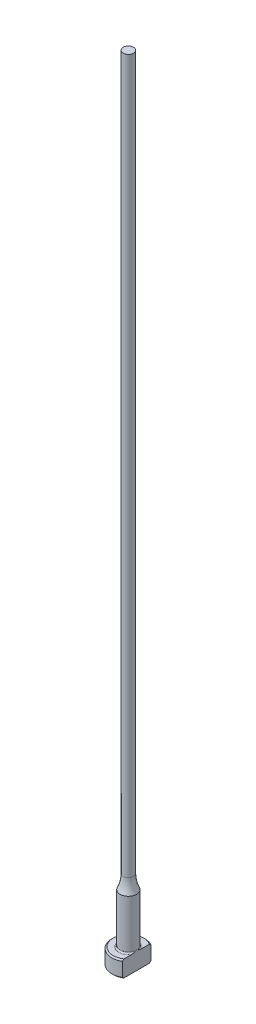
ISO-10303-21;
HEADER;
FILE_DESCRIPTION(('STEP AP214'),'2;1');
FILE_NAME('part.step','',(''),(''),'','','');
FILE_SCHEMA(('AUTOMOTIVE_DESIGN { 1 0 10303 214 1 1 1 1 }'));
ENDSEC;
DATA;
#1=APPLICATION_CONTEXT('core data for automotive mechanical design processes');
#2=APPLICATION_PROTOCOL_DEFINITION('international standard','automotive_design',2000,#1);
#3=PRODUCT_CONTEXT('',#1,'mechanical');
#4=PRODUCT('Part','Part','',(#3));
#5=PRODUCT_RELATED_PRODUCT_CATEGORY('part','',(#4));
#6=PRODUCT_DEFINITION_FORMATION('','',#4);
#7=PRODUCT_DEFINITION_CONTEXT('part definition',#1,'design');
#8=PRODUCT_DEFINITION('design','',#6,#7);
#9=PRODUCT_DEFINITION_SHAPE('','',#8);
#10=(LENGTH_UNIT() NAMED_UNIT(*) SI_UNIT(.MILLI.,.METRE.));
#11=(NAMED_UNIT(*) PLANE_ANGLE_UNIT() SI_UNIT($,.RADIAN.));
#12=(NAMED_UNIT(*) SI_UNIT($,.STERADIAN.) SOLID_ANGLE_UNIT());
#13=UNCERTAINTY_MEASURE_WITH_UNIT(LENGTH_MEASURE(1.E-05),#10,'distance_accuracy_value','');
#14=(GEOMETRIC_REPRESENTATION_CONTEXT(3) GLOBAL_UNCERTAINTY_ASSIGNED_CONTEXT((#13)) GLOBAL_UNIT_ASSIGNED_CONTEXT((#10,
#11,#12)) REPRESENTATION_CONTEXT('',''));
#15=CARTESIAN_POINT('',(0.,0.,0.));
#16=DIRECTION('',(0.,0.,1.));
#17=DIRECTION('',(1.,0.,0.));
#18=AXIS2_PLACEMENT_3D('',#15,#16,#17);
#19=CARTESIAN_POINT('',(-3.17499999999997,3.175,0.));
#20=DIRECTION('',(0.,1.,0.));
#21=DIRECTION('',(0.,0.,1.));
#22=AXIS2_PLACEMENT_3D('',#19,#20,#21);
#23=PLANE('',#22);
#24=CARTESIAN_POINT('',(0.,3.175,0.));
#25=DIRECTION('',(0.,1.,0.));
#26=DIRECTION('',(0.,0.,1.));
#27=AXIS2_PLACEMENT_3D('',#24,#25,#26);
#28=CIRCLE('',#27,2.92099999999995);
#29=CARTESIAN_POINT('',(1.58749999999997,3.175,-2.45195529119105));
#30=VERTEX_POINT('',#29);
#31=CARTESIAN_POINT('',(1.58749999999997,3.175,2.45195529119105));
#32=VERTEX_POINT('',#31);
#33=EDGE_CURVE('E105',#30,#32,#28,.T.);
#34=ORIENTED_EDGE('',*,*,#33,.T.);
#35=DIRECTION('',(0.,0.,1.));
#36=VECTOR('',#35,1.);
#37=CARTESIAN_POINT('',(1.58749999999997,3.17500000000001,2.74963065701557));
#38=LINE('',#37,#36);
#39=CARTESIAN_POINT('',(1.58749999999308,3.175,0.933255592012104));
#40=VERTEX_POINT('',#39);
#41=EDGE_CURVE('E126',#40,#32,#38,.T.);
#42=ORIENTED_EDGE('',*,*,#41,.F.);
#43=CARTESIAN_POINT('',(0.,3.175,0.));
#44=DIRECTION('',(0.,1.,0.));
#45=DIRECTION('',(0.,0.,1.));
#46=AXIS2_PLACEMENT_3D('',#43,#44,#45);
#47=CIRCLE('',#46,1.84149999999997);
#48=CARTESIAN_POINT('',(1.58749999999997,3.17500000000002,-0.933255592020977));
#49=VERTEX_POINT('',#48);
#50=EDGE_CURVE('E11',#40,#49,#47,.F.);
#51=ORIENTED_EDGE('',*,*,#50,.T.);
#52=EDGE_CURVE('E52',#30,#49,#38,.T.);
#53=ORIENTED_EDGE('',*,*,#52,.F.);
#54=EDGE_LOOP('',(#34,#42,#51,#53));
#55=FACE_BOUND('',#54,.T.);
#56=ADVANCED_FACE('F32',(#55),#23,.T.);
#57=CARTESIAN_POINT('',(0.,259.958771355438,0.));
#58=DIRECTION('',(0.,1.,0.));
#59=DIRECTION('',(0.,0.,1.));
#60=AXIS2_PLACEMENT_3D('',#57,#58,#59);
#61=CYLINDRICAL_SURFACE('',#60,3.17499999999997);
#62=CARTESIAN_POINT('',(0.,2.92100000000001,0.));
#63=DIRECTION('',(0.,1.,0.));
#64=DIRECTION('',(0.,0.,1.));
#65=AXIS2_PLACEMENT_3D('',#62,#63,#64);
#66=CIRCLE('',#65,3.17499999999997);
#67=CARTESIAN_POINT('',(1.58749999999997,2.92100000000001,2.74963065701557));
#68=VERTEX_POINT('',#67);
#69=CARTESIAN_POINT('',(1.58749999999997,2.92100000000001,-2.74963065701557));
#70=VERTEX_POINT('',#69);
#71=EDGE_CURVE('E98',#68,#70,#66,.F.);
#72=ORIENTED_EDGE('',*,*,#71,.T.);
#73=DIRECTION('',(0.,-1.,0.));
#74=VECTOR('',#73,1.);
#75=CARTESIAN_POINT('',(1.58749999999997,152.401,-2.74963065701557));
#76=LINE('',#75,#74);
#77=CARTESIAN_POINT('',(1.58749999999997,0.254000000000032,-2.74963065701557));
#78=VERTEX_POINT('',#77);
#79=EDGE_CURVE('E141',#70,#78,#76,.T.);
#80=ORIENTED_EDGE('',*,*,#79,.T.);
#81=CARTESIAN_POINT('',(0.,0.254000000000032,0.));
#82=DIRECTION('',(0.,-1.,0.));
#83=DIRECTION('',(0.,0.,-1.));
#84=AXIS2_PLACEMENT_3D('',#81,#82,#83);
#85=CIRCLE('',#84,3.17499999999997);
#86=CARTESIAN_POINT('',(1.58749999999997,0.254000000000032,2.74963065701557));
#87=VERTEX_POINT('',#86);
#88=EDGE_CURVE('E95',#78,#87,#85,.F.);
#89=ORIENTED_EDGE('',*,*,#88,.T.);
#90=DIRECTION('',(0.,-1.,0.));
#91=VECTOR('',#90,1.);
#92=CARTESIAN_POINT('',(1.58749999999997,152.401,2.74963065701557));
#93=LINE('',#92,#91);
#94=EDGE_CURVE('E88',#68,#87,#93,.T.);
#95=ORIENTED_EDGE('',*,*,#94,.F.);
#96=EDGE_LOOP('',(#72,#80,#89,#95));
#97=FACE_BOUND('',#96,.T.);
#98=ADVANCED_FACE('F191',(#97),#61,.T.);
#99=CARTESIAN_POINT('',(0.,0.,0.));
#100=DIRECTION('',(0.,-1.,0.));
#101=DIRECTION('',(0.,0.,-1.));
#102=AXIS2_PLACEMENT_3D('',#99,#100,#101);
#103=PLANE('',#102);
#104=CARTESIAN_POINT('',(0.,0.,0.));
#105=DIRECTION('',(0.,-1.,0.));
#106=DIRECTION('',(0.,0.,-1.));
#107=AXIS2_PLACEMENT_3D('',#104,#105,#106);
#108=CIRCLE('',#107,2.92099999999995);
#109=CARTESIAN_POINT('',(1.58749999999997,0.,2.45195529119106));
#110=VERTEX_POINT('',#109);
#111=CARTESIAN_POINT('',(1.58749999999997,0.,-2.45195529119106));
#112=VERTEX_POINT('',#111);
#113=EDGE_CURVE('E93',#110,#112,#108,.T.);
#114=ORIENTED_EDGE('',*,*,#113,.T.);
#115=DIRECTION('',(0.,0.,1.));
#116=VECTOR('',#115,1.);
#117=CARTESIAN_POINT('',(1.58749999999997,0.,2.74963065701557));
#118=LINE('',#117,#116);
#119=EDGE_CURVE('E78',#112,#110,#118,.T.);
#120=ORIENTED_EDGE('',*,*,#119,.T.);
#121=EDGE_LOOP('',(#114,#120));
#122=FACE_BOUND('',#121,.T.);
#123=ADVANCED_FACE('F97',(#122),#103,.T.);
#124=CARTESIAN_POINT('',(0.,3.17499999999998,0.));
#125=DIRECTION('',(0.,-1.,0.));
#126=DIRECTION('',(0.,0.,-1.));
#127=AXIS2_PLACEMENT_3D('',#124,#125,#126);
#128=CONICAL_SURFACE('',#127,2.92099999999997,0.7853981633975);
#129=ORIENTED_EDGE('',*,*,#71,.F.);
#130=CARTESIAN_POINT('',(1.58749999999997,-0.161620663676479,-6.0529050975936));
#131=CARTESIAN_POINT('',(1.58749999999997,-0.0288893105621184,-5.91567682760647));
#132=CARTESIAN_POINT('',(1.58749999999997,0.103699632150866,-5.77831035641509));
#133=CARTESIAN_POINT('',(1.58749999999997,0.36850839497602,-5.5032187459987));
#134=CARTESIAN_POINT('',(1.58749999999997,0.500728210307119,-5.36549360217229));
#135=CARTESIAN_POINT('',(1.58749999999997,0.764778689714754,-5.08953516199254));
#136=CARTESIAN_POINT('',(1.58749999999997,0.896609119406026,-4.95130164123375));
#137=CARTESIAN_POINT('',(1.58749999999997,1.15968706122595,-4.67428233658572));
#138=CARTESIAN_POINT('',(1.58749999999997,1.29093457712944,-4.53549655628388));
#139=CARTESIAN_POINT('',(1.58749999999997,1.55007705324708,-4.25997724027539));
#140=CARTESIAN_POINT('',(1.58749999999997,1.67798684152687,-4.12325766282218));
#141=CARTESIAN_POINT('',(1.58749999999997,1.93284861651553,-3.84892898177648));
#142=CARTESIAN_POINT('',(1.58749999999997,2.05980060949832,-3.71131988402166));
#143=CARTESIAN_POINT('',(1.58749999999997,2.31237508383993,-3.43493978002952));
#144=CARTESIAN_POINT('',(1.58749999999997,2.43799784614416,-3.29616903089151));
#145=CARTESIAN_POINT('',(1.58749999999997,2.68741369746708,-3.01699558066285));
#146=CARTESIAN_POINT('',(1.58749999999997,2.81120686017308,-2.87659294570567));
#147=CARTESIAN_POINT('',(1.58749999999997,3.0087586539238,-2.6481670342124));
#148=CARTESIAN_POINT('',(1.58749999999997,3.08336151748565,-2.56087478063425));
#149=CARTESIAN_POINT('',(1.58749999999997,3.23123871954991,-2.38515423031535));
#150=CARTESIAN_POINT('',(1.58749999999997,3.30451292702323,-2.29672582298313));
#151=CARTESIAN_POINT('',(1.58749999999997,3.45004422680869,-2.1174740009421));
#152=CARTESIAN_POINT('',(1.58749999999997,3.52228237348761,-2.02663514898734));
#153=CARTESIAN_POINT('',(1.58749999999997,3.6642309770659,-1.8430252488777));
#154=CARTESIAN_POINT('',(1.58749999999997,3.73394203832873,-1.75025467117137));
#155=CARTESIAN_POINT('',(1.58749999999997,3.87080633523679,-1.56067475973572));
#156=CARTESIAN_POINT('',(1.58749999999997,3.93790459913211,-1.46382547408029));
#157=CARTESIAN_POINT('',(1.58749999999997,4.06669147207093,-1.26632594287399));
#158=CARTESIAN_POINT('',(1.58749999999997,4.12837264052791,-1.16567073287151));
#159=CARTESIAN_POINT('',(1.58749999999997,4.2140225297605,-1.01165766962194));
#160=CARTESIAN_POINT('',(1.58749999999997,4.24127929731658,-0.960142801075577));
#161=CARTESIAN_POINT('',(1.58749999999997,4.29309798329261,-0.855780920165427));
#162=CARTESIAN_POINT('',(1.58749999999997,4.31765941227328,-0.802933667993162));
#163=CARTESIAN_POINT('',(1.58749999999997,4.38614656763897,-0.64246114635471));
#164=CARTESIAN_POINT('',(1.58749999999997,4.42510149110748,-0.532518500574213));
#165=CARTESIAN_POINT('',(1.58749999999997,4.46726244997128,-0.367680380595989));
#166=CARTESIAN_POINT('',(1.58749999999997,4.47844427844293,-0.314802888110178));
#167=CARTESIAN_POINT('',(1.58749999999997,4.495766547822,-0.2082097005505));
#168=CARTESIAN_POINT('',(1.58749999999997,4.50190743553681,-0.154494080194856));
#169=CARTESIAN_POINT('',(1.58749999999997,4.50871296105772,-0.0468792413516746));
#170=CARTESIAN_POINT('',(1.58749999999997,4.50939451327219,0.0070188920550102));
#171=CARTESIAN_POINT('',(1.58749999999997,4.50527679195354,0.114606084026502));
#172=CARTESIAN_POINT('',(1.58749999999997,4.50047706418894,0.168295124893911));
#173=CARTESIAN_POINT('',(1.58749999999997,4.48579689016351,0.274485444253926));
#174=CARTESIAN_POINT('',(1.58749999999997,4.47596081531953,0.326992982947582));
#175=CARTESIAN_POINT('',(1.58749999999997,4.45181809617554,0.430974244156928));
#176=CARTESIAN_POINT('',(1.58749999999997,4.43750969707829,0.48244755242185));
#177=CARTESIAN_POINT('',(1.58749999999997,4.40502489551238,0.584460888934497));
#178=CARTESIAN_POINT('',(1.58749999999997,4.38682724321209,0.634994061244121));
#179=CARTESIAN_POINT('',(1.58749999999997,4.34729308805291,0.734789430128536));
#180=CARTESIAN_POINT('',(1.58749999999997,4.32595722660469,0.784051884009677));
#181=CARTESIAN_POINT('',(1.58749999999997,4.25791922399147,0.930549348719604));
#182=CARTESIAN_POINT('',(1.58749999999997,4.20736047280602,1.02598802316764));
#183=CARTESIAN_POINT('',(1.58749999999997,4.09955451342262,1.2130431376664));
#184=CARTESIAN_POINT('',(1.58749999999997,4.04229912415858,1.30465471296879));
#185=CARTESIAN_POINT('',(1.58749999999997,3.9230874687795,1.4852621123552));
#186=CARTESIAN_POINT('',(1.58749999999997,3.86111349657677,1.57424615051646));
#187=CARTESIAN_POINT('',(1.58749999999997,3.73408621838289,1.74990003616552));
#188=CARTESIAN_POINT('',(1.58749999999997,3.66903444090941,1.8365709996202));
#189=CARTESIAN_POINT('',(1.58749999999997,3.53583371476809,2.00931764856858));
#190=CARTESIAN_POINT('',(1.58749999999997,3.46765527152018,2.09537048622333));
#191=CARTESIAN_POINT('',(1.58749999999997,3.32960643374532,2.26611736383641));
#192=CARTESIAN_POINT('',(1.58749999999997,3.25973586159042,2.35081125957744));
#193=CARTESIAN_POINT('',(1.58749999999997,3.04858139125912,2.60290121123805));
#194=CARTESIAN_POINT('',(1.58749999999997,2.90542388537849,2.76872537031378));
#195=CARTESIAN_POINT('',(1.58749999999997,2.64069522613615,3.06970913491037));
#196=CARTESIAN_POINT('',(1.58749999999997,2.5195945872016,3.20528660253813));
#197=CARTESIAN_POINT('',(1.58749999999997,2.275904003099,3.47510321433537));
#198=CARTESIAN_POINT('',(1.58749999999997,2.15331401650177,3.60934232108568));
#199=CARTESIAN_POINT('',(1.58749999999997,1.90694239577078,3.87695374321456));
#200=CARTESIAN_POINT('',(1.58749999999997,1.78315974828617,4.01032512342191));
#201=CARTESIAN_POINT('',(1.58749999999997,1.53478104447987,4.2763088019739));
#202=CARTESIAN_POINT('',(1.58749999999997,1.41018498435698,4.40892109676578));
#203=CARTESIAN_POINT('',(1.58749999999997,1.0457468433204,4.79499418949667));
#204=CARTESIAN_POINT('',(1.58749999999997,0.805076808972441,5.04767313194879));
#205=CARTESIAN_POINT('',(1.58749999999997,0.443121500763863,5.42550911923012));
#206=CARTESIAN_POINT('',(1.58749999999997,0.322378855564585,5.55118772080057));
#207=CARTESIAN_POINT('',(1.58749999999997,0.0805914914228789,5.80225207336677));
#208=CARTESIAN_POINT('',(1.58749999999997,-0.0404532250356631,5.92763782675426));
#209=CARTESIAN_POINT('',(1.58749999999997,-0.161620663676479,6.0529050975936));
#210=B_SPLINE_CURVE_WITH_KNOTS('',3,(#130,#131,#132,#133,#134,#135,#136,#137,#138,#139,#140,
#141,#142,#143,#144,#145,#146,#147,#148,#149,#150,#151,#152,#153,#154,#155,#156,#157,#158,#159,
#160,#161,#162,#163,#164,#165,#166,#167,#168,#169,#170,#171,#172,#173,#174,#175,#176,#177,#178,
#179,#180,#181,#182,#183,#184,#185,#186,#187,#188,#189,#190,#191,#192,#193,#194,#195,#196,#197,
#198,#199,#200,#201,#202,#203,#204,#205,#206,#207,#208,#209),.UNSPECIFIED.,.F.,.F.,(4,2,2,2,2,2,
2,2,2,2,2,2,2,2,2,2,2,2,2,2,2,2,2,2,2,2,2,2,2,2,2,2,2,2,2,2,2,2,2,4),(0.,0.572750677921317,
1.14550874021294,1.71856057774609,2.29160869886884,2.85328006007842,3.41494773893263,
3.97649423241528,4.53801804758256,4.88249307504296,5.22700189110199,5.57515326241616,
5.92322081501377,6.27657800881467,6.63041319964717,6.80518126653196,6.97998101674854,
7.32824262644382,7.49018491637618,7.65211285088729,7.813538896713,7.97497832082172,
8.13501929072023,8.29512313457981,8.4561251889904,8.61709438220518,8.94062993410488,
9.26456495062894,9.58978187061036,9.91483894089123,10.2441741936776,10.5735441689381,
11.2306812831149,11.7760337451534,12.3214014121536,12.8672825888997,13.4131663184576,
14.4600164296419,14.9828595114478,15.505698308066),.UNSPECIFIED.);
#211=EDGE_CURVE('E118',#32,#68,#210,.T.);
#212=ORIENTED_EDGE('',*,*,#211,.F.);
#213=ORIENTED_EDGE('',*,*,#33,.F.);
#214=EDGE_CURVE('E117',#70,#30,#210,.T.);
#215=ORIENTED_EDGE('',*,*,#214,.F.);
#216=EDGE_LOOP('',(#129,#212,#213,#215));
#217=FACE_BOUND('',#216,.T.);
#218=ADVANCED_FACE('F162',(#217),#128,.T.);
#219=CARTESIAN_POINT('',(0.,0.254000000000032,0.));
#220=DIRECTION('',(0.,1.,0.));
#221=DIRECTION('',(0.,0.,1.));
#222=AXIS2_PLACEMENT_3D('',#219,#220,#221);
#223=CONICAL_SURFACE('',#222,3.17499999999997,0.785398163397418);
#224=ORIENTED_EDGE('',*,*,#88,.F.);
#225=CARTESIAN_POINT('',(1.58749999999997,3.33662066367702,6.0529050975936));
#226=CARTESIAN_POINT('',(1.58749999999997,3.20388931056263,5.91567682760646));
#227=CARTESIAN_POINT('',(1.58749999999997,3.0713003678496,5.77831035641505));
#228=CARTESIAN_POINT('',(1.58749999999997,2.80649160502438,5.50321874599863));
#229=CARTESIAN_POINT('',(1.58749999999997,2.67427178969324,5.36549360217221));
#230=CARTESIAN_POINT('',(1.58749999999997,2.41022131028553,5.08953516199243));
#231=CARTESIAN_POINT('',(1.58749999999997,2.27839088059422,4.95130164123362));
#232=CARTESIAN_POINT('',(1.58749999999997,2.01531293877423,4.67428233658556));
#233=CARTESIAN_POINT('',(1.58749999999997,1.8840654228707,4.5354965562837));
#234=CARTESIAN_POINT('',(1.58749999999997,1.62492294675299,4.25997724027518));
#235=CARTESIAN_POINT('',(1.58749999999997,1.49701315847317,4.12325766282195));
#236=CARTESIAN_POINT('',(1.58749999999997,1.24215138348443,3.84892898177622));
#237=CARTESIAN_POINT('',(1.58749999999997,1.11519939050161,3.71131988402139));
#238=CARTESIAN_POINT('',(1.58749999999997,0.862624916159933,3.43493978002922));
#239=CARTESIAN_POINT('',(1.58749999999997,0.737002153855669,3.29616903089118));
#240=CARTESIAN_POINT('',(1.58749999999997,0.487586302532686,3.01699558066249));
#241=CARTESIAN_POINT('',(1.58749999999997,0.363793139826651,2.8765929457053));
#242=CARTESIAN_POINT('',(1.58749999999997,0.1662413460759,2.64816703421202));
#243=CARTESIAN_POINT('',(1.58749999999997,0.0916384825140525,2.56087478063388));
#244=CARTESIAN_POINT('',(1.58749999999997,-0.0562387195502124,2.385154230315));
#245=CARTESIAN_POINT('',(1.58749999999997,-0.129512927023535,2.29672582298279));
#246=CARTESIAN_POINT('',(1.58749999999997,-0.275044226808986,2.11747400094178));
#247=CARTESIAN_POINT('',(1.58749999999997,-0.34728237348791,2.02663514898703));
#248=CARTESIAN_POINT('',(1.58749999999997,-0.489230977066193,1.84302524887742));
#249=CARTESIAN_POINT('',(1.58749999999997,-0.558942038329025,1.75025467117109));
#250=CARTESIAN_POINT('',(1.58749999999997,-0.695806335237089,1.56067475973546));
#251=CARTESIAN_POINT('',(1.58749999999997,-0.762904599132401,1.46382547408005));
#252=CARTESIAN_POINT('',(1.58749999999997,-0.89169147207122,1.26632594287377));
#253=CARTESIAN_POINT('',(1.58749999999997,-0.953372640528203,1.16567073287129));
#254=CARTESIAN_POINT('',(1.58749999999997,-1.03902252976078,1.01165766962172));
#255=CARTESIAN_POINT('',(1.58749999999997,-1.06627929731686,0.960142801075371));
#256=CARTESIAN_POINT('',(1.58749999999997,-1.11809798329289,0.855780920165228));
#257=CARTESIAN_POINT('',(1.58749999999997,-1.14265941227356,0.802933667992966));
#258=CARTESIAN_POINT('',(1.58749999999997,-1.21114656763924,0.642461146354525));
#259=CARTESIAN_POINT('',(1.58749999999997,-1.25010149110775,0.532518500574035));
#260=CARTESIAN_POINT('',(1.58749999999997,-1.29226244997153,0.36768038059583));
#261=CARTESIAN_POINT('',(1.58749999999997,-1.30344427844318,0.31480288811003));
#262=CARTESIAN_POINT('',(1.58749999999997,-1.32076654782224,0.208209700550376));
#263=CARTESIAN_POINT('',(1.58749999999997,-1.32690743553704,0.154494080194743));
#264=CARTESIAN_POINT('',(1.58749999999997,-1.33371296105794,0.0468792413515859));
#265=CARTESIAN_POINT('',(1.58749999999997,-1.33439451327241,-0.0070188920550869));
#266=CARTESIAN_POINT('',(1.58749999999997,-1.33027679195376,-0.114606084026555));
#267=CARTESIAN_POINT('',(1.58749999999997,-1.32547706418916,-0.168295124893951));
#268=CARTESIAN_POINT('',(1.58749999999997,-1.31079689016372,-0.274485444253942));
#269=CARTESIAN_POINT('',(1.58749999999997,-1.30096081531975,-0.326992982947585));
#270=CARTESIAN_POINT('',(1.58749999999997,-1.27681809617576,-0.430974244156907));
#271=CARTESIAN_POINT('',(1.58749999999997,-1.26250969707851,-0.482447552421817));
#272=CARTESIAN_POINT('',(1.58749999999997,-1.2300248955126,-0.584460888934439));
#273=CARTESIAN_POINT('',(1.58749999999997,-1.21182724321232,-0.634994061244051));
#274=CARTESIAN_POINT('',(1.58749999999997,-1.17229308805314,-0.734789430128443));
#275=CARTESIAN_POINT('',(1.58749999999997,-1.15095722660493,-0.784051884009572));
#276=CARTESIAN_POINT('',(1.58749999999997,-1.08291922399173,-0.93054934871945));
#277=CARTESIAN_POINT('',(1.58749999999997,-1.0323604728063,-1.02598802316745));
#278=CARTESIAN_POINT('',(1.58749999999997,-0.92455451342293,-1.21304313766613));
#279=CARTESIAN_POINT('',(1.58749999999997,-0.867299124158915,-1.30465471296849));
#280=CARTESIAN_POINT('',(1.58749999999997,-0.748087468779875,-1.48526211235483));
#281=CARTESIAN_POINT('',(1.58749999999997,-0.686113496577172,-1.57424615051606));
#282=CARTESIAN_POINT('',(1.58749999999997,-0.559086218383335,-1.74990003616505));
#283=CARTESIAN_POINT('',(1.58749999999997,-0.494034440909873,-1.83657099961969));
#284=CARTESIAN_POINT('',(1.58749999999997,-0.360833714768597,-2.00931764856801));
#285=CARTESIAN_POINT('',(1.58749999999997,-0.292655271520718,-2.09537048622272));
#286=CARTESIAN_POINT('',(1.58749999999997,-0.154606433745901,-2.26611736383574));
#287=CARTESIAN_POINT('',(1.58749999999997,-0.084735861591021,-2.35081125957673));
#288=CARTESIAN_POINT('',(1.58749999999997,0.126418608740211,-2.60290121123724));
#289=CARTESIAN_POINT('',(1.58749999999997,0.26957611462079,-2.76872537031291));
#290=CARTESIAN_POINT('',(1.58749999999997,0.534304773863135,-3.06970913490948));
#291=CARTESIAN_POINT('',(1.58749999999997,0.655405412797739,-3.20528660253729));
#292=CARTESIAN_POINT('',(1.58749999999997,0.899095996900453,-3.47510321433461));
#293=CARTESIAN_POINT('',(1.58749999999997,1.02168598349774,-3.60934232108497));
#294=CARTESIAN_POINT('',(1.58749999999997,1.26805760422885,-3.87695374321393));
#295=CARTESIAN_POINT('',(1.58749999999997,1.39184025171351,-4.01032512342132));
#296=CARTESIAN_POINT('',(1.58749999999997,1.64021895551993,-4.2763088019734));
#297=CARTESIAN_POINT('',(1.58749999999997,1.76481501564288,-4.40892109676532));
#298=CARTESIAN_POINT('',(1.58749999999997,2.12925315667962,-4.79499418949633));
#299=CARTESIAN_POINT('',(1.58749999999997,2.36992319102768,-5.04767313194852));
#300=CARTESIAN_POINT('',(1.58749999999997,2.73187849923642,-5.42550911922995));
#301=CARTESIAN_POINT('',(1.58749999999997,2.85262114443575,-5.55118772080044));
#302=CARTESIAN_POINT('',(1.58749999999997,3.09440850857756,-5.8022520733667));
#303=CARTESIAN_POINT('',(1.58749999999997,3.21545322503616,-5.92763782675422));
#304=CARTESIAN_POINT('',(1.58749999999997,3.33662066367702,-6.0529050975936));
#305=B_SPLINE_CURVE_WITH_KNOTS('',3,(#225,#226,#227,#228,#229,#230,#231,#232,#233,#234,#235,
#236,#237,#238,#239,#240,#241,#242,#243,#244,#245,#246,#247,#248,#249,#250,#251,#252,#253,#254,
#255,#256,#257,#258,#259,#260,#261,#262,#263,#264,#265,#266,#267,#268,#269,#270,#271,#272,#273,
#274,#275,#276,#277,#278,#279,#280,#281,#282,#283,#284,#285,#286,#287,#288,#289,#290,#291,#292,
#293,#294,#295,#296,#297,#298,#299,#300,#301,#302,#303,#304),.UNSPECIFIED.,.F.,.F.,(4,2,2,2,2,2,
2,2,2,2,2,2,2,2,2,2,2,2,2,2,2,2,2,2,2,2,2,2,2,2,2,2,2,2,2,2,2,2,2,4),(0.,0.572750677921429,
1.14550874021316,1.71856057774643,2.29160869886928,2.85328006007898,3.41494773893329,
3.97649423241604,4.53801804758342,4.8824930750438,5.22700189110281,5.57515326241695,
5.92322081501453,6.27657800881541,6.63041319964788,6.80518126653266,6.97998101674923,
7.32824262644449,7.49018491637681,7.65211285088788,7.81353889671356,7.97497832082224,
8.13501929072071,8.29512313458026,8.45612518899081,8.61709438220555,8.94062993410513,
9.26456495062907,9.58978187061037,9.91483894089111,10.2441741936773,10.5735441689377,
11.2306812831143,11.776033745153,12.3214014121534,12.8672825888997,13.4131663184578,
14.4600164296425,14.9828595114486,15.505698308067),.UNSPECIFIED.);
#306=EDGE_CURVE('E81',#112,#78,#305,.T.);
#307=ORIENTED_EDGE('',*,*,#306,.F.);
#308=ORIENTED_EDGE('',*,*,#113,.F.);
#309=EDGE_CURVE('E84',#87,#110,#305,.T.);
#310=ORIENTED_EDGE('',*,*,#309,.F.);
#311=EDGE_LOOP('',(#224,#307,#308,#310));
#312=FACE_BOUND('',#311,.T.);
#313=ADVANCED_FACE('F92',(#312),#223,.T.);
#314=CARTESIAN_POINT('',(0.,3.42900000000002,0.));
#315=DIRECTION('',(0.,1.,0.));
#316=DIRECTION('',(0.,0.,1.));
#317=AXIS2_PLACEMENT_3D('',#314,#315,#316);
#318=TOROIDAL_SURFACE('',#317,1.84149999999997,0.254);
#319=CARTESIAN_POINT('',(1.58749999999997,3.42900000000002,0.));
#320=CARTESIAN_POINT('',(1.58749999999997,3.42899942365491,-1.9220514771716E-10));
#321=CARTESIAN_POINT('',(1.58749999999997,3.42899884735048,-1.2261161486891E-07));
#322=CARTESIAN_POINT('',(1.58749999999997,3.42899773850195,-5.09676365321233E-07));
#323=CARTESIAN_POINT('',(1.58749999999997,3.42899720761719,-7.78176328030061E-07));
#324=CARTESIAN_POINT('',(1.58749999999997,3.42899614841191,-1.42307272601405E-06));
#325=CARTESIAN_POINT('',(1.58749999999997,3.42899562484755,-1.80713867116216E-06));
#326=CARTESIAN_POINT('',(1.58749999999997,3.42899463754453,-2.63494846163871E-06));
#327=CARTESIAN_POINT('',(1.58749999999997,3.42899417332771,-3.07814756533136E-06));
#328=CARTESIAN_POINT('',(1.58749999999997,3.42899261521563,-4.66897357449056E-06));
#329=CARTESIAN_POINT('',(1.58749999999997,3.42899159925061,-5.89404908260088E-06));
#330=CARTESIAN_POINT('',(1.58749999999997,3.42898979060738,-8.42427511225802E-06));
#331=CARTESIAN_POINT('',(1.58749999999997,3.42898899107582,-9.7248057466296E-06));
#332=CARTESIAN_POINT('',(1.58749999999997,3.42898598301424,-1.48060601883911E-05));
#333=CARTESIAN_POINT('',(1.58749999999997,3.42898393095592,-1.86838281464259E-05));
#334=CARTESIAN_POINT('',(1.58749999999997,3.42898057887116,-2.63261117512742E-05));
#335=CARTESIAN_POINT('',(1.58749999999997,3.42897922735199,-3.00687417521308E-05));
#336=CARTESIAN_POINT('',(1.58749999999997,3.42897347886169,-4.60276298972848E-05));
#337=CARTESIAN_POINT('',(1.58749999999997,3.42896911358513,-5.8247019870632E-05));
#338=CARTESIAN_POINT('',(1.58749999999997,3.42896211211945,-8.11070097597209E-05));
#339=CARTESIAN_POINT('',(1.58749999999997,3.42895931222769,-9.16953114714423E-05));
#340=CARTESIAN_POINT('',(1.58749999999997,3.42893712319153,-0.000168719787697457));
#341=CARTESIAN_POINT('',(1.58749999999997,3.42890881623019,-0.000232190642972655));
#342=CARTESIAN_POINT('',(1.58749999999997,3.42880276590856,-0.000479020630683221));
#343=CARTESIAN_POINT('',(1.58749999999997,3.42873165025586,-0.00066443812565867));
#344=CARTESIAN_POINT('',(1.58749999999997,3.42845137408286,-0.0013844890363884));
#345=CARTESIAN_POINT('',(1.58749999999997,3.42823526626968,-0.00191701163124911));
#346=CARTESIAN_POINT('',(1.58749999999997,3.42735449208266,-0.00409774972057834));
#347=CARTESIAN_POINT('',(1.58749999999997,3.42669768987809,-0.00574830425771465));
#348=CARTESIAN_POINT('',(1.58749999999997,3.4174405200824,-0.0289985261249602));
#349=CARTESIAN_POINT('',(1.58749999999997,3.40878325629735,-0.0505816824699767));
#350=CARTESIAN_POINT('',(1.58749999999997,3.39189297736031,-0.0929947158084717));
#351=CARTESIAN_POINT('',(1.58749999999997,3.38365605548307,-0.11382315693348));
#352=CARTESIAN_POINT('',(1.58749999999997,3.36635393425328,-0.157956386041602));
#353=CARTESIAN_POINT('',(1.58749999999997,3.35730391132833,-0.181267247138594));
#354=CARTESIAN_POINT('',(1.58749999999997,3.33936775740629,-0.228222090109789));
#355=CARTESIAN_POINT('',(1.58749999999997,3.33048420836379,-0.25186705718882));
#356=CARTESIAN_POINT('',(1.58749999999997,3.30894496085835,-0.310512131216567));
#357=CARTESIAN_POINT('',(1.58749999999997,3.29649449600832,-0.345588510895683));
#358=CARTESIAN_POINT('',(1.58749999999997,3.27296975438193,-0.415278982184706));
#359=CARTESIAN_POINT('',(1.58749999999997,3.26186987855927,-0.449884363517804));
#360=CARTESIAN_POINT('',(1.58749999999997,3.2395832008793,-0.524471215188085));
#361=CARTESIAN_POINT('',(1.58749999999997,3.22860862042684,-0.564517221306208));
#362=CARTESIAN_POINT('',(1.58749999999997,3.20902534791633,-0.645529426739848));
#363=CARTESIAN_POINT('',(1.58749999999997,3.20043582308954,-0.686500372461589));
#364=CARTESIAN_POINT('',(1.58749999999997,3.18611712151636,-0.771546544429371));
#365=CARTESIAN_POINT('',(1.58749999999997,3.18059550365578,-0.815658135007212));
#366=CARTESIAN_POINT('',(1.58749999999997,3.17455396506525,-0.904117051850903));
#367=CARTESIAN_POINT('',(1.58749999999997,3.17401361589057,-0.948462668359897));
#368=CARTESIAN_POINT('',(1.58749999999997,3.17898948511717,-1.02531896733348));
#369=CARTESIAN_POINT('',(1.58749999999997,3.1829739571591,-1.05792141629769));
#370=CARTESIAN_POINT('',(1.58749999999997,3.19569167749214,-1.12184393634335));
#371=CARTESIAN_POINT('',(1.58749999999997,3.20436049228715,-1.1531753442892));
#372=CARTESIAN_POINT('',(1.58749999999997,3.22236152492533,-1.19946468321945));
#373=CARTESIAN_POINT('',(1.58749999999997,3.2295150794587,-1.21526783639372));
#374=CARTESIAN_POINT('',(1.58749999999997,3.24587062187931,-1.24583726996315));
#375=CARTESIAN_POINT('',(1.58749999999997,3.25507530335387,-1.26060215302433));
#376=CARTESIAN_POINT('',(1.58749999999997,3.27378481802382,-1.28575815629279));
#377=CARTESIAN_POINT('',(1.58749999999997,3.28289001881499,-1.29644383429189));
#378=CARTESIAN_POINT('',(1.58749999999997,3.30268460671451,-1.31623154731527));
#379=CARTESIAN_POINT('',(1.58749999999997,3.31337067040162,-1.32533681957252));
#380=CARTESIAN_POINT('',(1.58749999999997,3.33349977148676,-1.33941140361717));
#381=CARTESIAN_POINT('',(1.58749999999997,3.34261446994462,-1.34484814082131));
#382=CARTESIAN_POINT('',(1.58749999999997,3.36161455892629,-1.35416329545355));
#383=CARTESIAN_POINT('',(1.58749999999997,3.37149946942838,-1.35804267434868));
#384=CARTESIAN_POINT('',(1.58749999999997,3.39188678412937,-1.36398436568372));
#385=CARTESIAN_POINT('',(1.58749999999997,3.40239309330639,-1.36603350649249));
#386=CARTESIAN_POINT('',(1.58749999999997,3.42360372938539,-1.3680840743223));
#387=CARTESIAN_POINT('',(1.58749999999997,3.43430795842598,-1.36808648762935));
#388=CARTESIAN_POINT('',(1.58749999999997,3.45433283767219,-1.36616208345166));
#389=CARTESIAN_POINT('',(1.58749999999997,3.46367506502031,-1.36444960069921));
#390=CARTESIAN_POINT('',(1.58749999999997,3.48195519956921,-1.35953338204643));
#391=CARTESIAN_POINT('',(1.58749999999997,3.49089304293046,-1.3563294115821));
#392=CARTESIAN_POINT('',(1.58749999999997,3.50850302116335,-1.34848006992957));
#393=CARTESIAN_POINT('',(1.58749999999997,3.5171531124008,-1.34378578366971));
#394=CARTESIAN_POINT('',(1.58749999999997,3.53371257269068,-1.33324445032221));
#395=CARTESIAN_POINT('',(1.58749999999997,3.54162163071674,-1.32739692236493));
#396=CARTESIAN_POINT('',(1.58749999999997,3.56107121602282,-1.31107304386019));
#397=CARTESIAN_POINT('',(1.58749999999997,3.57202221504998,-1.29989286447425));
#398=CARTESIAN_POINT('',(1.58749999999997,3.59202509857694,-1.27593566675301));
#399=CARTESIAN_POINT('',(1.58749999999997,3.60107086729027,-1.26315370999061));
#400=CARTESIAN_POINT('',(1.58749999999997,3.62186023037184,-1.22930733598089));
#401=CARTESIAN_POINT('',(1.58749999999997,3.63240584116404,-1.20751096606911));
#402=CARTESIAN_POINT('',(1.58749999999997,3.65004643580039,-1.16266144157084));
#403=CARTESIAN_POINT('',(1.58749999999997,3.65714435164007,-1.13960937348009));
#404=CARTESIAN_POINT('',(1.58749999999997,3.67265428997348,-1.07603916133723));
#405=CARTESIAN_POINT('',(1.58749999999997,3.67834921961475,-1.03486686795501));
#406=CARTESIAN_POINT('',(1.58749999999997,3.68382880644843,-0.951558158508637));
#407=CARTESIAN_POINT('',(1.58749999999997,3.68350976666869,-0.909417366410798));
#408=CARTESIAN_POINT('',(1.58749999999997,3.67745397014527,-0.811383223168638));
#409=CARTESIAN_POINT('',(1.58749999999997,3.66993873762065,-0.755610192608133));
#410=CARTESIAN_POINT('',(1.58749999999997,3.64933373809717,-0.644937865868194));
#411=CARTESIAN_POINT('',(1.58749999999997,3.63621897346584,-0.59004364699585));
#412=CARTESIAN_POINT('',(1.58749999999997,3.60740922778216,-0.485757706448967));
#413=CARTESIAN_POINT('',(1.58749999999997,3.59201096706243,-0.436281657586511));
#414=CARTESIAN_POINT('',(1.58749999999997,3.55922497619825,-0.338551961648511));
#415=CARTESIAN_POINT('',(1.58749999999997,3.5418584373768,-0.290291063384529));
#416=CARTESIAN_POINT('',(1.58749999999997,3.51760237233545,-0.225557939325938));
#417=CARTESIAN_POINT('',(1.58749999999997,3.51126413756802,-0.208874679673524));
#418=CARTESIAN_POINT('',(1.58749999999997,3.49830042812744,-0.17512392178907));
#419=CARTESIAN_POINT('',(1.58749999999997,3.49167176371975,-0.158057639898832));
#420=CARTESIAN_POINT('',(1.58749999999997,3.47585523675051,-0.117638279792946));
#421=CARTESIAN_POINT('',(1.58749999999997,3.46662970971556,-0.0943002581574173));
#422=CARTESIAN_POINT('',(1.58749999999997,3.44889695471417,-0.0497824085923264));
#423=CARTESIAN_POINT('',(1.58749999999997,3.44040039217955,-0.028598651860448));
#424=CARTESIAN_POINT('',(1.58749999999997,3.43130364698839,-0.00575168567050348));
#425=CARTESIAN_POINT('',(1.58749999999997,3.43064818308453,-0.00410451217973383));
#426=CARTESIAN_POINT('',(1.58749999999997,3.42976776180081,-0.00192459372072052));
#427=CARTESIAN_POINT('',(1.58749999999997,3.42955062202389,-0.00138952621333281));
#428=CARTESIAN_POINT('',(1.58749999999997,3.42926908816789,-0.000666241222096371));
#429=CARTESIAN_POINT('',(1.58749999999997,3.42919771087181,-0.000480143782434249));
#430=CARTESIAN_POINT('',(1.58749999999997,3.42909131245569,-0.000232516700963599));
#431=CARTESIAN_POINT('',(1.58749999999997,3.42906294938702,-0.000168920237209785));
#432=CARTESIAN_POINT('',(1.58749999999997,3.42904072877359,-9.17527162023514E-05));
#433=CARTESIAN_POINT('',(1.58749999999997,3.42903792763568,-8.11550293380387E-05));
#434=CARTESIAN_POINT('',(1.58749999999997,3.42903091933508,-5.82743948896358E-05));
#435=CARTESIAN_POINT('',(1.58749999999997,3.42902654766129,-4.60440001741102E-05));
#436=CARTESIAN_POINT('',(1.58749999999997,3.42902079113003,-3.00727682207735E-05));
#437=CARTESIAN_POINT('',(1.58749999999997,3.42901943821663,-2.63286807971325E-05));
#438=CARTESIAN_POINT('',(1.58749999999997,3.42901608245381,-1.86836529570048E-05));
#439=CARTESIAN_POINT('',(1.58749999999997,3.4290140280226,-1.48046517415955E-05));
#440=CARTESIAN_POINT('',(1.58749999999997,3.42901101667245,-9.72223943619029E-06));
#441=CARTESIAN_POINT('',(1.58749999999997,3.42901021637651,-8.42159649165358E-06));
#442=CARTESIAN_POINT('',(1.58749999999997,3.42900840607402,-5.89129729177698E-06));
#443=CARTESIAN_POINT('',(1.58749999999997,3.42900738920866,-4.66626867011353E-06));
#444=CARTESIAN_POINT('',(1.58749999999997,3.42900582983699,-3.07568803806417E-06));
#445=CARTESIAN_POINT('',(1.58749999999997,3.42900536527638,-2.63259565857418E-06));
#446=CARTESIAN_POINT('',(1.58749999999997,3.4290043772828,-1.80506085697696E-06));
#447=CARTESIAN_POINT('',(1.58749999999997,3.42900385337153,-1.42116387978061E-06));
#448=CARTESIAN_POINT('',(1.58749999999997,3.42900279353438,-7.76675643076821E-07));
#449=CARTESIAN_POINT('',(1.58749999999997,3.42900226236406,-5.08406487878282E-07));
#450=CARTESIAN_POINT('',(1.58749999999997,3.42900115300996,-1.21901887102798E-07));
#451=CARTESIAN_POINT('',(1.58749999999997,3.42900057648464,1.92251677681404E-10));
#452=CARTESIAN_POINT('',(1.58749999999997,3.42900000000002,0.));
#453=B_SPLINE_CURVE_WITH_KNOTS('',3,(#319,#320,#321,#322,#323,#324,#325,#326,#327,#328,#329,
#330,#331,#332,#333,#334,#335,#336,#337,#338,#339,#340,#341,#342,#343,#344,#345,#346,#347,#348,
#349,#350,#351,#352,#353,#354,#355,#356,#357,#358,#359,#360,#361,#362,#363,#364,#365,#366,#367,
#368,#369,#370,#371,#372,#373,#374,#375,#376,#377,#378,#379,#380,#381,#382,#383,#384,#385,#386,
#387,#388,#389,#390,#391,#392,#393,#394,#395,#396,#397,#398,#399,#400,#401,#402,#403,#404,#405,
#406,#407,#408,#409,#410,#411,#412,#413,#414,#415,#416,#417,#418,#419,#420,#421,#422,#423,#424,
#425,#426,#427,#428,#429,#430,#431,#432,#433,#434,#435,#436,#437,#438,#439,#440,#441,#442,#443,
#444,#445,#446,#447,#448,#449,#450,#451,#452),.UNSPECIFIED.,.T.,.F.,(4,2,2,2,2,2,2,2,2,2,2,2,2,
2,2,2,2,2,2,2,2,2,2,2,2,2,2,2,2,2,2,2,2,2,2,2,2,2,2,2,2,2,2,2,2,2,2,2,2,2,2,2,2,2,2,2,2,2,2,2,2,
2,2,2,2,2,4),(0.,1.72815458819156E-06,3.50429255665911E-06,5.44431004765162E-06,
7.3675525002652E-06,1.2119089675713E-05,1.66953775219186E-05,2.98160400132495E-05,
4.17409564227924E-05,8.0660475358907E-05,0.000113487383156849,0.000321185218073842,
0.000917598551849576,0.00264089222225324,0.00797105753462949,0.0777276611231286,
0.144923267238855,0.219939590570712,0.295714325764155,0.407362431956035,0.516367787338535,
0.640878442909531,0.766362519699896,0.899536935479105,1.03216495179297,1.13045740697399,
1.22743103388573,1.27935899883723,1.33135556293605,1.37333248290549,1.41522237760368,
1.44693946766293,1.47863694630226,1.51056074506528,1.54246916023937,1.57083210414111,
1.59919951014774,1.62861579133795,1.65804436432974,1.70472658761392,1.75155645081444,
1.82378709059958,1.89595619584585,2.01995471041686,2.1460932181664,2.31447224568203,
2.48361094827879,2.6389891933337,2.79283011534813,2.84637031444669,2.9012946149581,
2.97658236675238,3.04504771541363,3.05036697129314,3.05209849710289,3.05269709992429,
3.05290520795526,3.05293806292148,3.05297701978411,3.05298895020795,3.05300207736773,
3.05300665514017,3.0530114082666,3.05301333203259,3.05301527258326,3.05301704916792,
3.05301877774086),.UNSPECIFIED.);
#454=CARTESIAN_POINT('',(1.58749999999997,3.42900000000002,0.));
#455=VERTEX_POINT('',#454);
#456=EDGE_CURVE('E47',#455,#49,#453,.T.);
#457=ORIENTED_EDGE('',*,*,#456,.T.);
#458=ORIENTED_EDGE('',*,*,#50,.F.);
#459=CARTESIAN_POINT('',(1.58749999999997,3.42900000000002,0.));
#460=CARTESIAN_POINT('',(1.58749999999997,3.42900057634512,1.9220512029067E-10));
#461=CARTESIAN_POINT('',(1.58749999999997,3.42900115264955,1.22611614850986E-07));
#462=CARTESIAN_POINT('',(1.58749999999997,3.42900226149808,5.09676365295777E-07));
#463=CARTESIAN_POINT('',(1.58749999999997,3.42900279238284,7.78176328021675E-07));
#464=CARTESIAN_POINT('',(1.58749999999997,3.42900385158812,1.42307272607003E-06));
#465=CARTESIAN_POINT('',(1.58749999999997,3.42900437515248,1.80713867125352E-06));
#466=CARTESIAN_POINT('',(1.58749999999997,3.4290053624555,2.63494846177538E-06));
#467=CARTESIAN_POINT('',(1.58749999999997,3.42900582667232,3.0781475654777E-06));
#468=CARTESIAN_POINT('',(1.58749999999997,3.4290073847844,4.66897357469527E-06));
#469=CARTESIAN_POINT('',(1.58749999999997,3.42900840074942,5.89404908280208E-06));
#470=CARTESIAN_POINT('',(1.58749999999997,3.42901020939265,8.42427511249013E-06));
#471=CARTESIAN_POINT('',(1.58749999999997,3.42901100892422,9.72480574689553E-06));
#472=CARTESIAN_POINT('',(1.58749999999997,3.42901401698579,1.48060601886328E-05));
#473=CARTESIAN_POINT('',(1.58749999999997,3.42901606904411,1.86838281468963E-05));
#474=CARTESIAN_POINT('',(1.58749999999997,3.42901942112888,2.63261117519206E-05));
#475=CARTESIAN_POINT('',(1.58749999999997,3.42902077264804,3.00687417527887E-05));
#476=CARTESIAN_POINT('',(1.58749999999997,3.42902652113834,4.60276298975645E-05));
#477=CARTESIAN_POINT('',(1.58749999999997,3.4290308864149,5.82470198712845E-05));
#478=CARTESIAN_POINT('',(1.58749999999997,3.42903788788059,8.11070097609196E-05));
#479=CARTESIAN_POINT('',(1.58749999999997,3.42904068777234,9.16953114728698E-05));
#480=CARTESIAN_POINT('',(1.58749999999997,3.4290628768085,0.000168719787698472));
#481=CARTESIAN_POINT('',(1.58749999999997,3.42909118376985,0.000232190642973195));
#482=CARTESIAN_POINT('',(1.58749999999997,3.42919723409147,0.000479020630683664));
#483=CARTESIAN_POINT('',(1.58749999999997,3.42926834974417,0.000664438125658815));
#484=CARTESIAN_POINT('',(1.58749999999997,3.42954862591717,0.00138448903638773));
#485=CARTESIAN_POINT('',(1.58749999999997,3.42976473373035,0.00191701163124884));
#486=CARTESIAN_POINT('',(1.58749999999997,3.43064550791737,0.00409774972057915));
#487=CARTESIAN_POINT('',(1.58749999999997,3.43130231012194,0.00574830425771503));
#488=CARTESIAN_POINT('',(1.58749999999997,3.44055947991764,0.0289985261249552));
#489=CARTESIAN_POINT('',(1.58749999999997,3.44921674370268,0.0505816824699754));
#490=CARTESIAN_POINT('',(1.58749999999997,3.46610702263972,0.0929947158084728));
#491=CARTESIAN_POINT('',(1.58749999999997,3.47434394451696,0.11382315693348));
#492=CARTESIAN_POINT('',(1.58749999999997,3.49164606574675,0.157956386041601));
#493=CARTESIAN_POINT('',(1.58749999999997,3.5006960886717,0.181267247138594));
#494=CARTESIAN_POINT('',(1.58749999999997,3.51863224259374,0.228222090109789));
#495=CARTESIAN_POINT('',(1.58749999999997,3.52751579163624,0.25186705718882));
#496=CARTESIAN_POINT('',(1.58749999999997,3.54905503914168,0.310512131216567));
#497=CARTESIAN_POINT('',(1.58749999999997,3.56150550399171,0.345588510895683));
#498=CARTESIAN_POINT('',(1.58749999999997,3.5850302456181,0.415278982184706));
#499=CARTESIAN_POINT('',(1.58749999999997,3.59613012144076,0.449884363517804));
#500=CARTESIAN_POINT('',(1.58749999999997,3.61841679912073,0.524471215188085));
#501=CARTESIAN_POINT('',(1.58749999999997,3.62939137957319,0.564517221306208));
#502=CARTESIAN_POINT('',(1.58749999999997,3.6489746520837,0.645529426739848));
#503=CARTESIAN_POINT('',(1.58749999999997,3.65756417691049,0.686500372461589));
#504=CARTESIAN_POINT('',(1.58749999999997,3.67188287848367,0.771546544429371));
#505=CARTESIAN_POINT('',(1.58749999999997,3.67740449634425,0.815658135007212));
#506=CARTESIAN_POINT('',(1.58749999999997,3.68344603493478,0.904117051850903));
#507=CARTESIAN_POINT('',(1.58749999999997,3.68398638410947,0.948462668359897));
#508=CARTESIAN_POINT('',(1.58749999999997,3.67901051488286,1.02531896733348));
#509=CARTESIAN_POINT('',(1.58749999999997,3.67502604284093,1.05792141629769));
#510=CARTESIAN_POINT('',(1.58749999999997,3.66230832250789,1.12184393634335));
#511=CARTESIAN_POINT('',(1.58749999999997,3.65363950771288,1.1531753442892));
#512=CARTESIAN_POINT('',(1.58749999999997,3.6356384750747,1.19946468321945));
#513=CARTESIAN_POINT('',(1.58749999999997,3.62848492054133,1.21526783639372));
#514=CARTESIAN_POINT('',(1.58749999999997,3.61212937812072,1.24583726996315));
#515=CARTESIAN_POINT('',(1.58749999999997,3.60292469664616,1.26060215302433));
#516=CARTESIAN_POINT('',(1.58749999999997,3.58421518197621,1.28575815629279));
#517=CARTESIAN_POINT('',(1.58749999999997,3.57510998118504,1.29644383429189));
#518=CARTESIAN_POINT('',(1.58749999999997,3.55531539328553,1.31623154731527));
#519=CARTESIAN_POINT('',(1.58749999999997,3.54462932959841,1.32533681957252));
#520=CARTESIAN_POINT('',(1.58749999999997,3.52450022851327,1.33941140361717));
#521=CARTESIAN_POINT('',(1.58749999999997,3.51538553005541,1.34484814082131));
#522=CARTESIAN_POINT('',(1.58749999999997,3.49638544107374,1.35416329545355));
#523=CARTESIAN_POINT('',(1.58749999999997,3.48650053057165,1.35804267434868));
#524=CARTESIAN_POINT('',(1.58749999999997,3.46611321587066,1.36398436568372));
#525=CARTESIAN_POINT('',(1.58749999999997,3.45560690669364,1.36603350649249));
#526=CARTESIAN_POINT('',(1.58749999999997,3.43439627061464,1.3680840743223));
#527=CARTESIAN_POINT('',(1.58749999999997,3.42369204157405,1.36808648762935));
#528=CARTESIAN_POINT('',(1.58749999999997,3.40366716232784,1.36616208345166));
#529=CARTESIAN_POINT('',(1.58749999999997,3.39432493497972,1.36444960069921));
#530=CARTESIAN_POINT('',(1.58749999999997,3.37604480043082,1.35953338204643));
#531=CARTESIAN_POINT('',(1.58749999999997,3.36710695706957,1.3563294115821));
#532=CARTESIAN_POINT('',(1.58749999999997,3.34949697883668,1.34848006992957));
#533=CARTESIAN_POINT('',(1.58749999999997,3.34084688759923,1.34378578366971));
#534=CARTESIAN_POINT('',(1.58749999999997,3.32428742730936,1.33324445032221));
#535=CARTESIAN_POINT('',(1.58749999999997,3.31637836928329,1.32739692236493));
#536=CARTESIAN_POINT('',(1.58749999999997,3.29692878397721,1.31107304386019));
#537=CARTESIAN_POINT('',(1.58749999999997,3.28597778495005,1.29989286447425));
#538=CARTESIAN_POINT('',(1.58749999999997,3.26597490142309,1.27593566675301));
#539=CARTESIAN_POINT('',(1.58749999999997,3.25692913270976,1.26315370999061));
#540=CARTESIAN_POINT('',(1.58749999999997,3.23613976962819,1.22930733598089));
#541=CARTESIAN_POINT('',(1.58749999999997,3.22559415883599,1.20751096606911));
#542=CARTESIAN_POINT('',(1.58749999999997,3.20795356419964,1.16266144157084));
#543=CARTESIAN_POINT('',(1.58749999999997,3.20085564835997,1.13960937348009));
#544=CARTESIAN_POINT('',(1.58749999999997,3.18534571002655,1.07603916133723));
#545=CARTESIAN_POINT('',(1.58749999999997,3.17965078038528,1.03486686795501));
#546=CARTESIAN_POINT('',(1.58749999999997,3.1741711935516,0.951558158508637));
#547=CARTESIAN_POINT('',(1.58749999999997,3.17449023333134,0.909417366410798));
#548=CARTESIAN_POINT('',(1.58749999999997,3.18054602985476,0.811383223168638));
#549=CARTESIAN_POINT('',(1.58749999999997,3.18806126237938,0.755610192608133));
#550=CARTESIAN_POINT('',(1.58749999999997,3.20866626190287,0.644937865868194));
#551=CARTESIAN_POINT('',(1.58749999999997,3.2217810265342,0.59004364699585));
#552=CARTESIAN_POINT('',(1.58749999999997,3.25059077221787,0.485757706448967));
#553=CARTESIAN_POINT('',(1.58749999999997,3.2659890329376,0.43628165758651));
#554=CARTESIAN_POINT('',(1.58749999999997,3.29877502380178,0.338551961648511));
#555=CARTESIAN_POINT('',(1.58749999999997,3.31614156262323,0.290291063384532));
#556=CARTESIAN_POINT('',(1.58749999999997,3.34039762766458,0.225557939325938));
#557=CARTESIAN_POINT('',(1.58749999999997,3.346735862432,0.208874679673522));
#558=CARTESIAN_POINT('',(1.58749999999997,3.35969957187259,0.175123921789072));
#559=CARTESIAN_POINT('',(1.58749999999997,3.3663282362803,0.15805763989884));
#560=CARTESIAN_POINT('',(1.58749999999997,3.3821447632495,0.117638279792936));
#561=CARTESIAN_POINT('',(1.58749999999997,3.39137029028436,0.0943002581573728));
#562=CARTESIAN_POINT('',(1.58749999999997,3.40910304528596,0.0497824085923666));
#563=CARTESIAN_POINT('',(1.58749999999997,3.41759960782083,0.0285986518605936));
#564=CARTESIAN_POINT('',(1.58749999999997,3.42669635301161,0.00575168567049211));
#565=CARTESIAN_POINT('',(1.58749999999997,3.42735181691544,0.00410451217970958));
#566=CARTESIAN_POINT('',(1.58749999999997,3.42823223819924,0.00192459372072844));
#567=CARTESIAN_POINT('',(1.58749999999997,3.42844937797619,0.00138952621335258));
#568=CARTESIAN_POINT('',(1.58749999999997,3.42873091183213,0.000666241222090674));
#569=CARTESIAN_POINT('',(1.58749999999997,3.42880228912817,0.000480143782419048));
#570=CARTESIAN_POINT('',(1.58749999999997,3.42890868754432,0.000232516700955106));
#571=CARTESIAN_POINT('',(1.58749999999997,3.42893705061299,0.000168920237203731));
#572=CARTESIAN_POINT('',(1.58749999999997,3.42895927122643,9.17527161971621E-05));
#573=CARTESIAN_POINT('',(1.58749999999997,3.42896207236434,8.1155029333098E-05));
#574=CARTESIAN_POINT('',(1.58749999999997,3.42896908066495,5.82743948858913E-05));
#575=CARTESIAN_POINT('',(1.58749999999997,3.42897345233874,4.60440001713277E-05));
#576=CARTESIAN_POINT('',(1.58749999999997,3.42897920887,3.00727682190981E-05));
#577=CARTESIAN_POINT('',(1.58749999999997,3.42898056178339,2.63286807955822E-05));
#578=CARTESIAN_POINT('',(1.58749999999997,3.42898391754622,1.86836529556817E-05));
#579=CARTESIAN_POINT('',(1.58749999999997,3.42898597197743,1.48046517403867E-05));
#580=CARTESIAN_POINT('',(1.58749999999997,3.42898898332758,9.72223943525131E-06));
#581=CARTESIAN_POINT('',(1.58749999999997,3.42898978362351,8.42159649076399E-06));
#582=CARTESIAN_POINT('',(1.58749999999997,3.42899159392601,5.89129729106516E-06));
#583=CARTESIAN_POINT('',(1.58749999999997,3.42899261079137,4.66626866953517E-06));
#584=CARTESIAN_POINT('',(1.58749999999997,3.42899417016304,3.0756880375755E-06));
#585=CARTESIAN_POINT('',(1.58749999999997,3.42899463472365,2.63259565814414E-06));
#586=CARTESIAN_POINT('',(1.58749999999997,3.42899562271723,1.80506085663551E-06));
#587=CARTESIAN_POINT('',(1.58749999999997,3.42899614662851,1.42116387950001E-06));
#588=CARTESIAN_POINT('',(1.58749999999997,3.42899720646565,7.7667564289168E-07));
#589=CARTESIAN_POINT('',(1.58749999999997,3.42899773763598,5.0840648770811E-07));
#590=CARTESIAN_POINT('',(1.58749999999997,3.42899884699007,1.21901887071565E-07));
#591=CARTESIAN_POINT('',(1.58749999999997,3.42899942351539,-1.92251650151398E-10));
#592=CARTESIAN_POINT('',(1.58749999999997,3.42900000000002,0.));
#593=B_SPLINE_CURVE_WITH_KNOTS('',3,(#459,#460,#461,#462,#463,#464,#465,#466,#467,#468,#469,
#470,#471,#472,#473,#474,#475,#476,#477,#478,#479,#480,#481,#482,#483,#484,#485,#486,#487,#488,
#489,#490,#491,#492,#493,#494,#495,#496,#497,#498,#499,#500,#501,#502,#503,#504,#505,#506,#507,
#508,#509,#510,#511,#512,#513,#514,#515,#516,#517,#518,#519,#520,#521,#522,#523,#524,#525,#526,
#527,#528,#529,#530,#531,#532,#533,#534,#535,#536,#537,#538,#539,#540,#541,#542,#543,#544,#545,
#546,#547,#548,#549,#550,#551,#552,#553,#554,#555,#556,#557,#558,#559,#560,#561,#562,#563,#564,
#565,#566,#567,#568,#569,#570,#571,#572,#573,#574,#575,#576,#577,#578,#579,#580,#581,#582,#583,
#584,#585,#586,#587,#588,#589,#590,#591,#592),.UNSPECIFIED.,.T.,.F.,(4,2,2,2,2,2,2,2,2,2,2,2,2,
2,2,2,2,2,2,2,2,2,2,2,2,2,2,2,2,2,2,2,2,2,2,2,2,2,2,2,2,2,2,2,2,2,2,2,2,2,2,2,2,2,2,2,2,2,2,2,2,
2,2,2,2,2,4),(0.,1.72815458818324E-06,3.50429255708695E-06,5.44431004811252E-06,
7.36755250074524E-06,1.21190896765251E-05,1.66953775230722E-05,2.98160400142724E-05,
4.17409564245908E-05,8.06604753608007E-05,0.000113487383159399,0.000321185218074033,
0.000917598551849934,0.00264089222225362,0.00797105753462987,0.077727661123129,
0.144923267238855,0.219939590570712,0.295714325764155,0.407362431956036,0.516367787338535,
0.640878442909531,0.766362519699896,0.899536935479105,1.03216495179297,1.13045740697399,
1.22743103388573,1.27935899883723,1.33135556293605,1.37333248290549,1.41522237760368,
1.44693946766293,1.47863694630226,1.51056074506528,1.54246916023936,1.57083210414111,
1.59919951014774,1.62861579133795,1.65804436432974,1.70472658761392,1.75155645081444,
1.82378709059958,1.89595619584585,2.01995471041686,2.1460932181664,2.31447224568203,
2.48361094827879,2.6389891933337,2.79283011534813,2.84637031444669,2.9012946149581,
2.97658236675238,3.04504771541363,3.05036697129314,3.05209849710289,3.05269709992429,
3.05290520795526,3.05293806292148,3.05297701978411,3.05298895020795,3.05300207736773,
3.05300665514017,3.0530114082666,3.05301333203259,3.05301527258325,3.05301704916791,
3.05301877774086),.UNSPECIFIED.);
#594=EDGE_CURVE('E147',#40,#455,#593,.T.);
#595=ORIENTED_EDGE('',*,*,#594,.T.);
#596=CARTESIAN_POINT('',(0.,3.42900000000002,0.));
#597=DIRECTION('',(0.,1.,0.));
#598=DIRECTION('',(0.,0.,1.));
#599=AXIS2_PLACEMENT_3D('',#596,#597,#598);
#600=CIRCLE('',#599,1.58749999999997);
#601=EDGE_CURVE('E40',#455,#455,#600,.T.);
#602=ORIENTED_EDGE('',*,*,#601,.F.);
#603=EDGE_LOOP('',(#457,#458,#595,#602));
#604=FACE_BOUND('',#603,.T.);
#605=ADVANCED_FACE('F34',(#604),#318,.F.);
#606=CARTESIAN_POINT('',(-0.99186999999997,152.4,0.));
#607=DIRECTION('',(0.,1.,0.));
#608=DIRECTION('',(0.,0.,1.));
#609=AXIS2_PLACEMENT_3D('',#606,#607,#608);
#610=PLANE('',#609);
#611=CARTESIAN_POINT('',(0.,152.4,0.));
#612=DIRECTION('',(0.,1.,0.));
#613=DIRECTION('',(0.,0.,1.));
#614=AXIS2_PLACEMENT_3D('',#611,#612,#613);
#615=CIRCLE('',#614,0.99186999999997);
#616=CARTESIAN_POINT('',(0.,152.4,0.99186999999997));
#617=VERTEX_POINT('',#616);
#618=EDGE_CURVE('E108',#617,#617,#615,.T.);
#619=ORIENTED_EDGE('',*,*,#618,.T.);
#620=EDGE_LOOP('',(#619));
#621=FACE_BOUND('',#620,.T.);
#622=ADVANCED_FACE('F180',(#621),#610,.T.);
#623=CARTESIAN_POINT('',(0.,259.958771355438,0.));
#624=DIRECTION('',(0.,1.,0.));
#625=DIRECTION('',(0.,0.,1.));
#626=AXIS2_PLACEMENT_3D('',#623,#624,#625);
#627=CYLINDRICAL_SURFACE('',#626,0.991869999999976);
#628=CARTESIAN_POINT('',(0.,15.3850932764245,0.));
#629=DIRECTION('',(0.,1.,0.));
#630=DIRECTION('',(0.,0.,1.));
#631=AXIS2_PLACEMENT_3D('',#628,#629,#630);
#632=CIRCLE('',#631,0.991869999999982);
#633=CARTESIAN_POINT('',(0.,15.3850932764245,0.991869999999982));
#634=VERTEX_POINT('',#633);
#635=EDGE_CURVE('E111',#634,#634,#632,.T.);
#636=ORIENTED_EDGE('',*,*,#635,.T.);
#637=EDGE_LOOP('',(#636));
#638=FACE_BOUND('',#637,.T.);
#639=ORIENTED_EDGE('',*,*,#618,.F.);
#640=EDGE_LOOP('',(#639));
#641=FACE_BOUND('',#640,.T.);
#642=ADVANCED_FACE('F174',(#638,#641),#627,.T.);
#643=CARTESIAN_POINT('',(0.,15.3850932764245,0.));
#644=DIRECTION('',(0.,1.,0.));
#645=DIRECTION('',(0.,0.,1.));
#646=AXIS2_PLACEMENT_3D('',#643,#644,#645);
#647=TOROIDAL_SURFACE('',#646,7.34186999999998,6.35);
#648=CARTESIAN_POINT('',(0.,12.7,0.));
#649=DIRECTION('',(0.,1.,0.));
#650=DIRECTION('',(0.,0.,1.));
#651=AXIS2_PLACEMENT_3D('',#648,#649,#650);
#652=CIRCLE('',#651,1.58749999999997);
#653=CARTESIAN_POINT('',(0.,12.7,1.58749999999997));
#654=VERTEX_POINT('',#653);
#655=EDGE_CURVE('E114',#654,#654,#652,.T.);
#656=ORIENTED_EDGE('',*,*,#655,.T.);
#657=EDGE_LOOP('',(#656));
#658=FACE_BOUND('',#657,.T.);
#659=ORIENTED_EDGE('',*,*,#635,.F.);
#660=EDGE_LOOP('',(#659));
#661=FACE_BOUND('',#660,.T.);
#662=ADVANCED_FACE('F168',(#658,#661),#647,.F.);
#663=CARTESIAN_POINT('',(0.,259.958771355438,0.));
#664=DIRECTION('',(0.,1.,0.));
#665=DIRECTION('',(0.,0.,1.));
#666=AXIS2_PLACEMENT_3D('',#663,#664,#665);
#667=CYLINDRICAL_SURFACE('',#666,1.58749999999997);
#668=ORIENTED_EDGE('',*,*,#601,.T.);
#669=EDGE_LOOP('',(#668));
#670=FACE_BOUND('',#669,.T.);
#671=ORIENTED_EDGE('',*,*,#655,.F.);
#672=EDGE_LOOP('',(#671));
#673=FACE_BOUND('',#672,.T.);
#674=ADVANCED_FACE('F165',(#670,#673),#667,.T.);
#675=CARTESIAN_POINT('',(1.58749999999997,152.401,2.74963065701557));
#676=DIRECTION('',(1.,0.,0.));
#677=DIRECTION('',(0.,0.,-1.));
#678=AXIS2_PLACEMENT_3D('',#675,#676,#677);
#679=PLANE('',#678);
#680=ORIENTED_EDGE('',*,*,#309,.T.);
#681=ORIENTED_EDGE('',*,*,#119,.F.);
#682=ORIENTED_EDGE('',*,*,#306,.T.);
#683=ORIENTED_EDGE('',*,*,#79,.F.);
#684=ORIENTED_EDGE('',*,*,#214,.T.);
#685=ORIENTED_EDGE('',*,*,#52,.T.);
#686=ORIENTED_EDGE('',*,*,#456,.F.);
#687=ORIENTED_EDGE('',*,*,#594,.F.);
#688=ORIENTED_EDGE('',*,*,#41,.T.);
#689=ORIENTED_EDGE('',*,*,#211,.T.);
#690=ORIENTED_EDGE('',*,*,#94,.T.);
#691=EDGE_LOOP('',(#680,#681,#682,#683,#684,#685,#686,#687,#688,#689,#690));
#692=FACE_BOUND('',#691,.T.);
#693=ADVANCED_FACE('F80',(#692),#679,.T.);
#694=CLOSED_SHELL('',(#56,#98,#123,#218,#313,#605,#622,#642,#662,#674,#693));
#695=MANIFOLD_SOLID_BREP('B2',#694);
#696=ADVANCED_BREP_SHAPE_REPRESENTATION('',(#18,#695),#14);
#697=SHAPE_DEFINITION_REPRESENTATION(#9,#696);
ENDSEC;
END-ISO-10303-21;
